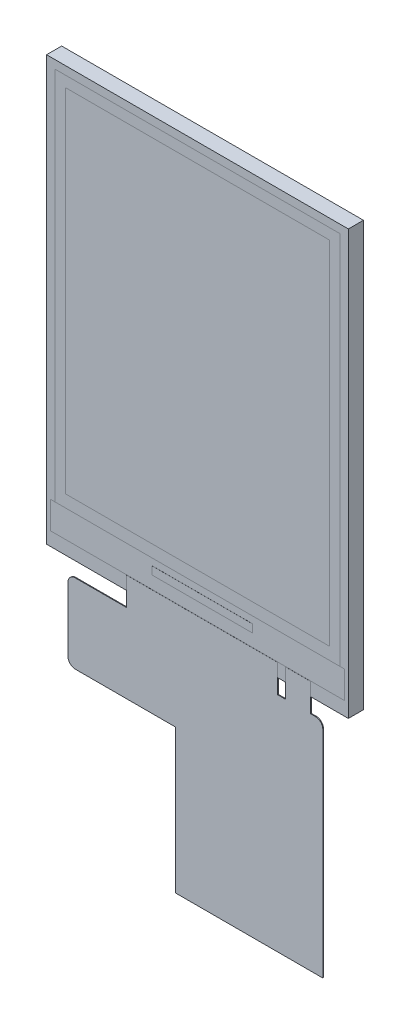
from build123d import *

# Parameters (mm, degrees)
SKETCH1_W              = 42
SKETCH1_H              = 59
BOSS_EXTRUDE1_DEPTH    = 2.1
BOSS_EXTRUDE3_START    = 2.01
SKETCH2_W              = 20.5
SKETCH2_H              = 20
BOSS_EXTRUDE3_DEPTH    = 0.1
SKETCH4_W              = 0.35
SKETCH4_H              = 3.5
BOSS_EXTRUDE4_DEPTH    = 0.1
BOSS_EXTRUDE4_2_DEPTH  = 0.1
BOSS_EXTRUDE4_3_DEPTH  = 0.1
BOSS_EXTRUDE4_4_DEPTH  = 0.1
BOSS_EXTRUDE4_5_DEPTH  = 0.1
BOSS_EXTRUDE4_6_DEPTH  = 0.1
BOSS_EXTRUDE4_7_DEPTH  = 0.1
BOSS_EXTRUDE4_8_DEPTH  = 0.1
BOSS_EXTRUDE4_9_DEPTH  = 0.1
BOSS_EXTRUDE4_10_DEPTH = 0.1
BOSS_EXTRUDE4_11_DEPTH = 0.1
BOSS_EXTRUDE4_12_DEPTH = 0.1
BOSS_EXTRUDE4_13_DEPTH = 0.1
BOSS_EXTRUDE4_14_DEPTH = 0.1
BOSS_EXTRUDE4_15_DEPTH = 0.1
BOSS_EXTRUDE4_16_DEPTH = 0.1
BOSS_EXTRUDE4_17_DEPTH = 0.1
BOSS_EXTRUDE4_18_DEPTH = 0.1
BOSS_EXTRUDE4_19_DEPTH = 0.1
BOSS_EXTRUDE4_20_DEPTH = 0.1
BOSS_EXTRUDE4_21_DEPTH = 0.1
BOSS_EXTRUDE4_22_DEPTH = 0.1
BOSS_EXTRUDE4_23_DEPTH = 0.1
BOSS_EXTRUDE4_24_DEPTH = 0.1
BOSS_EXTRUDE4_25_DEPTH = 0.1
BOSS_EXTRUDE4_26_DEPTH = 0.1
BOSS_EXTRUDE4_27_DEPTH = 0.1
BOSS_EXTRUDE4_28_DEPTH = 0.1
BOSS_EXTRUDE4_29_DEPTH = 0.1
BOSS_EXTRUDE4_30_DEPTH = 0.1
BOSS_EXTRUDE4_31_DEPTH = 0.1
BOSS_EXTRUDE4_32_DEPTH = 0.1
BOSS_EXTRUDE4_33_DEPTH = 0.1
BOSS_EXTRUDE4_34_DEPTH = 0.1
BOSS_EXTRUDE4_35_DEPTH = 0.1
BOSS_EXTRUDE4_36_DEPTH = 0.1
BOSS_EXTRUDE4_37_DEPTH = 0.1
BOSS_EXTRUDE4_38_DEPTH = 0.1
BOSS_EXTRUDE4_39_DEPTH = 0.1
BOSS_EXTRUDE4_40_DEPTH = 0.1
SKETCH5_W              = 14
SKETCH5_H              = 1.103163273
BOSS_EXTRUDE5_DEPTH    = 0.01


with BuildPart() as part:
    # Sketch1 → Boss-Extrude1 (new body)
    with BuildSketch(Plane.XY):
        Rectangle(SKETCH1_W, SKETCH1_H)
    extrude(amount=BOSS_EXTRUDE1_DEPTH)

    # Sketch5 → Boss-Extrude5 (add)
    with BuildSketch(Plane.XY.offset(2.1)):
        with Locations((0.655362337, -25.308418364)):
            Rectangle(SKETCH5_W, SKETCH5_H)
    extrude(amount=BOSS_EXTRUDE5_DEPTH)


with BuildPart() as body_2:
    # Sketch2 → Boss-Extrude3 (new body)
    with BuildSketch(Plane.XY.offset(BOSS_EXTRUDE3_START)):
        with BuildLine():
            Line((11.155362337, -27.65), (-9.844637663, -27.65))
            Line((-9.844637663, -27.65), (-9.844637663, -31.55))
            Line((-9.844637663, -31.55), (-17, -31.55))
            ThreePointArc((-17, -31.55), (-17.707106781, -31.842893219), (-18, -32.55))
            Line((-18, -32.55), (-18, -41.55))
            ThreePointArc((-18, -41.55), (-17.707106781, -42.257106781), (-17, -42.55))
            Line((-17, -42.55), (-3.05, -42.55))
            Line((-3.05, -42.55), (17.45, -42.55))
            Line((17.45, -42.55), (17.45, -32.55))
            ThreePointArc((17.45, -32.55), (17.157106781, -31.842893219), (16.45, -31.55))
            Line((16.45, -31.55), (15.75, -31.55))
            Line((15.75, -31.55), (15.75, -27.65))
            Line((15.75, -27.65), (12.25, -27.65))
            Line((12.25, -27.65), (12.25, -31.55))
            Line((12.25, -31.55), (11.155362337, -31.55))
            Line((11.155362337, -31.55), (11.155362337, -27.65))
        make_face()
        with Locations((7.2, -52.55)):
            Rectangle(SKETCH2_W, SKETCH2_H)
    extrude(amount=BOSS_EXTRUDE3_DEPTH)


with BuildPart() as body_3:
    # Sketch4 → Boss-Extrude4 (new body)
    with BuildSketch(Plane(origin=(0, 0, 2.01), x_dir=(-1, 0, 0), z_dir=(0, 0, -1))):
        with Locations((-16.95, -60.8)):
            Rectangle(SKETCH4_W, SKETCH4_H)
    extrude(amount=BOSS_EXTRUDE4_DEPTH)


with BuildPart() as body_4:
    # Sketch4 → Boss-Extrude4 2 (new body)
    with BuildSketch(Plane(origin=(0, 0, 2.01), x_dir=(-1, 0, 0), z_dir=(0, 0, -1))):
        with Locations((-16.45, -60.8)):
            Rectangle(SKETCH4_W, SKETCH4_H)
    extrude(amount=BOSS_EXTRUDE4_2_DEPTH)


with BuildPart() as body_5:
    # Sketch4 → Boss-Extrude4 3 (new body)
    with BuildSketch(Plane(origin=(0, 0, 2.01), x_dir=(-1, 0, 0), z_dir=(0, 0, -1))):
        with Locations((-15.95, -60.8)):
            Rectangle(SKETCH4_W, SKETCH4_H)
    extrude(amount=BOSS_EXTRUDE4_3_DEPTH)


with BuildPart() as body_6:
    # Sketch4 → Boss-Extrude4 4 (new body)
    with BuildSketch(Plane(origin=(0, 0, 2.01), x_dir=(-1, 0, 0), z_dir=(0, 0, -1))):
        with Locations((-15.45, -60.8)):
            Rectangle(SKETCH4_W, SKETCH4_H)
    extrude(amount=BOSS_EXTRUDE4_4_DEPTH)


with BuildPart() as body_7:
    # Sketch4 → Boss-Extrude4 5 (new body)
    with BuildSketch(Plane(origin=(0, 0, 2.01), x_dir=(-1, 0, 0), z_dir=(0, 0, -1))):
        with Locations((-14.95, -60.8)):
            Rectangle(SKETCH4_W, SKETCH4_H)
    extrude(amount=BOSS_EXTRUDE4_5_DEPTH)


with BuildPart() as body_8:
    # Sketch4 → Boss-Extrude4 6 (new body)
    with BuildSketch(Plane(origin=(0, 0, 2.01), x_dir=(-1, 0, 0), z_dir=(0, 0, -1))):
        with Locations((-14.45, -60.8)):
            Rectangle(SKETCH4_W, SKETCH4_H)
    extrude(amount=BOSS_EXTRUDE4_6_DEPTH)


with BuildPart() as body_9:
    # Sketch4 → Boss-Extrude4 7 (new body)
    with BuildSketch(Plane(origin=(0, 0, 2.01), x_dir=(-1, 0, 0), z_dir=(0, 0, -1))):
        with Locations((-13.95, -60.8)):
            Rectangle(SKETCH4_W, SKETCH4_H)
    extrude(amount=BOSS_EXTRUDE4_7_DEPTH)


with BuildPart() as body_10:
    # Sketch4 → Boss-Extrude4 8 (new body)
    with BuildSketch(Plane(origin=(0, 0, 2.01), x_dir=(-1, 0, 0), z_dir=(0, 0, -1))):
        with Locations((-13.45, -60.8)):
            Rectangle(SKETCH4_W, SKETCH4_H)
    extrude(amount=BOSS_EXTRUDE4_8_DEPTH)


with BuildPart() as body_11:
    # Sketch4 → Boss-Extrude4 9 (new body)
    with BuildSketch(Plane(origin=(0, 0, 2.01), x_dir=(-1, 0, 0), z_dir=(0, 0, -1))):
        with Locations((-12.95, -60.8)):
            Rectangle(SKETCH4_W, SKETCH4_H)
    extrude(amount=BOSS_EXTRUDE4_9_DEPTH)


with BuildPart() as body_12:
    # Sketch4 → Boss-Extrude4 10 (new body)
    with BuildSketch(Plane(origin=(0, 0, 2.01), x_dir=(-1, 0, 0), z_dir=(0, 0, -1))):
        with Locations((-12.45, -60.8)):
            Rectangle(SKETCH4_W, SKETCH4_H)
    extrude(amount=BOSS_EXTRUDE4_10_DEPTH)


with BuildPart() as body_13:
    # Sketch4 → Boss-Extrude4 11 (new body)
    with BuildSketch(Plane(origin=(0, 0, 2.01), x_dir=(-1, 0, 0), z_dir=(0, 0, -1))):
        with Locations((-11.95, -60.8)):
            Rectangle(SKETCH4_W, SKETCH4_H)
    extrude(amount=BOSS_EXTRUDE4_11_DEPTH)


with BuildPart() as body_14:
    # Sketch4 → Boss-Extrude4 12 (new body)
    with BuildSketch(Plane(origin=(0, 0, 2.01), x_dir=(-1, 0, 0), z_dir=(0, 0, -1))):
        with Locations((-11.45, -60.8)):
            Rectangle(SKETCH4_W, SKETCH4_H)
    extrude(amount=BOSS_EXTRUDE4_12_DEPTH)


with BuildPart() as body_15:
    # Sketch4 → Boss-Extrude4 13 (new body)
    with BuildSketch(Plane(origin=(0, 0, 2.01), x_dir=(-1, 0, 0), z_dir=(0, 0, -1))):
        with Locations((-10.95, -60.8)):
            Rectangle(SKETCH4_W, SKETCH4_H)
    extrude(amount=BOSS_EXTRUDE4_13_DEPTH)


with BuildPart() as body_16:
    # Sketch4 → Boss-Extrude4 14 (new body)
    with BuildSketch(Plane(origin=(0, 0, 2.01), x_dir=(-1, 0, 0), z_dir=(0, 0, -1))):
        with Locations((-10.45, -60.8)):
            Rectangle(SKETCH4_W, SKETCH4_H)
    extrude(amount=BOSS_EXTRUDE4_14_DEPTH)


with BuildPart() as body_17:
    # Sketch4 → Boss-Extrude4 15 (new body)
    with BuildSketch(Plane(origin=(0, 0, 2.01), x_dir=(-1, 0, 0), z_dir=(0, 0, -1))):
        with Locations((-9.95, -60.8)):
            Rectangle(SKETCH4_W, SKETCH4_H)
    extrude(amount=BOSS_EXTRUDE4_15_DEPTH)


with BuildPart() as body_18:
    # Sketch4 → Boss-Extrude4 16 (new body)
    with BuildSketch(Plane(origin=(0, 0, 2.01), x_dir=(-1, 0, 0), z_dir=(0, 0, -1))):
        with Locations((-9.45, -60.8)):
            Rectangle(SKETCH4_W, SKETCH4_H)
    extrude(amount=BOSS_EXTRUDE4_16_DEPTH)


with BuildPart() as body_19:
    # Sketch4 → Boss-Extrude4 17 (new body)
    with BuildSketch(Plane(origin=(0, 0, 2.01), x_dir=(-1, 0, 0), z_dir=(0, 0, -1))):
        with Locations((-8.95, -60.8)):
            Rectangle(SKETCH4_W, SKETCH4_H)
    extrude(amount=BOSS_EXTRUDE4_17_DEPTH)


with BuildPart() as body_20:
    # Sketch4 → Boss-Extrude4 18 (new body)
    with BuildSketch(Plane(origin=(0, 0, 2.01), x_dir=(-1, 0, 0), z_dir=(0, 0, -1))):
        with Locations((-8.45, -60.8)):
            Rectangle(SKETCH4_W, SKETCH4_H)
    extrude(amount=BOSS_EXTRUDE4_18_DEPTH)


with BuildPart() as body_21:
    # Sketch4 → Boss-Extrude4 19 (new body)
    with BuildSketch(Plane(origin=(0, 0, 2.01), x_dir=(-1, 0, 0), z_dir=(0, 0, -1))):
        with Locations((-7.95, -60.8)):
            Rectangle(SKETCH4_W, SKETCH4_H)
    extrude(amount=BOSS_EXTRUDE4_19_DEPTH)


with BuildPart() as body_22:
    # Sketch4 → Boss-Extrude4 20 (new body)
    with BuildSketch(Plane(origin=(0, 0, 2.01), x_dir=(-1, 0, 0), z_dir=(0, 0, -1))):
        with Locations((-7.45, -60.8)):
            Rectangle(SKETCH4_W, SKETCH4_H)
    extrude(amount=BOSS_EXTRUDE4_20_DEPTH)


with BuildPart() as body_23:
    # Sketch4 → Boss-Extrude4 21 (new body)
    with BuildSketch(Plane(origin=(0, 0, 2.01), x_dir=(-1, 0, 0), z_dir=(0, 0, -1))):
        with Locations((-6.95, -60.8)):
            Rectangle(SKETCH4_W, SKETCH4_H)
    extrude(amount=BOSS_EXTRUDE4_21_DEPTH)


with BuildPart() as body_24:
    # Sketch4 → Boss-Extrude4 22 (new body)
    with BuildSketch(Plane(origin=(0, 0, 2.01), x_dir=(-1, 0, 0), z_dir=(0, 0, -1))):
        with Locations((-6.45, -60.8)):
            Rectangle(SKETCH4_W, SKETCH4_H)
    extrude(amount=BOSS_EXTRUDE4_22_DEPTH)


with BuildPart() as body_25:
    # Sketch4 → Boss-Extrude4 23 (new body)
    with BuildSketch(Plane(origin=(0, 0, 2.01), x_dir=(-1, 0, 0), z_dir=(0, 0, -1))):
        with Locations((-5.95, -60.8)):
            Rectangle(SKETCH4_W, SKETCH4_H)
    extrude(amount=BOSS_EXTRUDE4_23_DEPTH)


with BuildPart() as body_26:
    # Sketch4 → Boss-Extrude4 24 (new body)
    with BuildSketch(Plane(origin=(0, 0, 2.01), x_dir=(-1, 0, 0), z_dir=(0, 0, -1))):
        with Locations((-5.45, -60.8)):
            Rectangle(SKETCH4_W, SKETCH4_H)
    extrude(amount=BOSS_EXTRUDE4_24_DEPTH)


with BuildPart() as body_27:
    # Sketch4 → Boss-Extrude4 25 (new body)
    with BuildSketch(Plane(origin=(0, 0, 2.01), x_dir=(-1, 0, 0), z_dir=(0, 0, -1))):
        with Locations((-4.95, -60.8)):
            Rectangle(SKETCH4_W, SKETCH4_H)
    extrude(amount=BOSS_EXTRUDE4_25_DEPTH)


with BuildPart() as body_28:
    # Sketch4 → Boss-Extrude4 26 (new body)
    with BuildSketch(Plane(origin=(0, 0, 2.01), x_dir=(-1, 0, 0), z_dir=(0, 0, -1))):
        with Locations((-4.45, -60.8)):
            Rectangle(SKETCH4_W, SKETCH4_H)
    extrude(amount=BOSS_EXTRUDE4_26_DEPTH)


with BuildPart() as body_29:
    # Sketch4 → Boss-Extrude4 27 (new body)
    with BuildSketch(Plane(origin=(0, 0, 2.01), x_dir=(-1, 0, 0), z_dir=(0, 0, -1))):
        with Locations((-3.95, -60.8)):
            Rectangle(SKETCH4_W, SKETCH4_H)
    extrude(amount=BOSS_EXTRUDE4_27_DEPTH)


with BuildPart() as body_30:
    # Sketch4 → Boss-Extrude4 28 (new body)
    with BuildSketch(Plane(origin=(0, 0, 2.01), x_dir=(-1, 0, 0), z_dir=(0, 0, -1))):
        with Locations((-3.45, -60.8)):
            Rectangle(SKETCH4_W, SKETCH4_H)
    extrude(amount=BOSS_EXTRUDE4_28_DEPTH)


with BuildPart() as body_31:
    # Sketch4 → Boss-Extrude4 29 (new body)
    with BuildSketch(Plane(origin=(0, 0, 2.01), x_dir=(-1, 0, 0), z_dir=(0, 0, -1))):
        with Locations((-2.95, -60.8)):
            Rectangle(SKETCH4_W, SKETCH4_H)
    extrude(amount=BOSS_EXTRUDE4_29_DEPTH)


with BuildPart() as body_32:
    # Sketch4 → Boss-Extrude4 30 (new body)
    with BuildSketch(Plane(origin=(0, 0, 2.01), x_dir=(-1, 0, 0), z_dir=(0, 0, -1))):
        with Locations((-2.45, -60.8)):
            Rectangle(SKETCH4_W, SKETCH4_H)
    extrude(amount=BOSS_EXTRUDE4_30_DEPTH)


with BuildPart() as body_33:
    # Sketch4 → Boss-Extrude4 31 (new body)
    with BuildSketch(Plane(origin=(0, 0, 2.01), x_dir=(-1, 0, 0), z_dir=(0, 0, -1))):
        with Locations((-1.95, -60.8)):
            Rectangle(SKETCH4_W, SKETCH4_H)
    extrude(amount=BOSS_EXTRUDE4_31_DEPTH)


with BuildPart() as body_34:
    # Sketch4 → Boss-Extrude4 32 (new body)
    with BuildSketch(Plane(origin=(0, 0, 2.01), x_dir=(-1, 0, 0), z_dir=(0, 0, -1))):
        with Locations((-1.45, -60.8)):
            Rectangle(SKETCH4_W, SKETCH4_H)
    extrude(amount=BOSS_EXTRUDE4_32_DEPTH)


with BuildPart() as body_35:
    # Sketch4 → Boss-Extrude4 33 (new body)
    with BuildSketch(Plane(origin=(0, 0, 2.01), x_dir=(-1, 0, 0), z_dir=(0, 0, -1))):
        with Locations((-0.95, -60.8)):
            Rectangle(SKETCH4_W, SKETCH4_H)
    extrude(amount=BOSS_EXTRUDE4_33_DEPTH)


with BuildPart() as body_36:
    # Sketch4 → Boss-Extrude4 34 (new body)
    with BuildSketch(Plane(origin=(0, 0, 2.01), x_dir=(-1, 0, 0), z_dir=(0, 0, -1))):
        with Locations((-0.45, -60.8)):
            Rectangle(SKETCH4_W, SKETCH4_H)
    extrude(amount=BOSS_EXTRUDE4_34_DEPTH)


with BuildPart() as body_37:
    # Sketch4 → Boss-Extrude4 35 (new body)
    with BuildSketch(Plane(origin=(0, 0, 2.01), x_dir=(-1, 0, 0), z_dir=(0, 0, -1))):
        with Locations((0.05, -60.8)):
            Rectangle(SKETCH4_W, SKETCH4_H)
    extrude(amount=BOSS_EXTRUDE4_35_DEPTH)


with BuildPart() as body_38:
    # Sketch4 → Boss-Extrude4 36 (new body)
    with BuildSketch(Plane(origin=(0, 0, 2.01), x_dir=(-1, 0, 0), z_dir=(0, 0, -1))):
        with Locations((0.55, -60.8)):
            Rectangle(SKETCH4_W, SKETCH4_H)
    extrude(amount=BOSS_EXTRUDE4_36_DEPTH)


with BuildPart() as body_39:
    # Sketch4 → Boss-Extrude4 37 (new body)
    with BuildSketch(Plane(origin=(0, 0, 2.01), x_dir=(-1, 0, 0), z_dir=(0, 0, -1))):
        with Locations((1.05, -60.8)):
            Rectangle(SKETCH4_W, SKETCH4_H)
    extrude(amount=BOSS_EXTRUDE4_37_DEPTH)


with BuildPart() as body_40:
    # Sketch4 → Boss-Extrude4 38 (new body)
    with BuildSketch(Plane(origin=(0, 0, 2.01), x_dir=(-1, 0, 0), z_dir=(0, 0, -1))):
        with Locations((1.55, -60.8)):
            Rectangle(SKETCH4_W, SKETCH4_H)
    extrude(amount=BOSS_EXTRUDE4_38_DEPTH)


with BuildPart() as body_41:
    # Sketch4 → Boss-Extrude4 39 (new body)
    with BuildSketch(Plane(origin=(0, 0, 2.01), x_dir=(-1, 0, 0), z_dir=(0, 0, -1))):
        with Locations((2.05, -60.8)):
            Rectangle(SKETCH4_W, SKETCH4_H)
    extrude(amount=BOSS_EXTRUDE4_39_DEPTH)


with BuildPart() as body_42:
    # Sketch4 → Boss-Extrude4 40 (new body)
    with BuildSketch(Plane(origin=(0, 0, 2.01), x_dir=(-1, 0, 0), z_dir=(0, 0, -1))):
        with Locations((2.55, -60.8)):
            Rectangle(SKETCH4_W, SKETCH4_H)
    extrude(amount=BOSS_EXTRUDE4_40_DEPTH)


solid = Compound([part.part, body_2.part, body_3.part, body_4.part, body_5.part, body_6.part, body_7.part, body_8.part, body_9.part, body_10.part, body_11.part, body_12.part, body_13.part, body_14.part, body_15.part, body_16.part, body_17.part, body_18.part, body_19.part, body_20.part, body_21.part, body_22.part, body_23.part, body_24.part, body_25.part, body_26.part, body_27.part, body_28.part, body_29.part, body_30.part, body_31.part, body_32.part, body_33.part, body_34.part, body_35.part, body_36.part, body_37.part, body_38.part, body_39.part, body_40.part, body_41.part, body_42.part])
